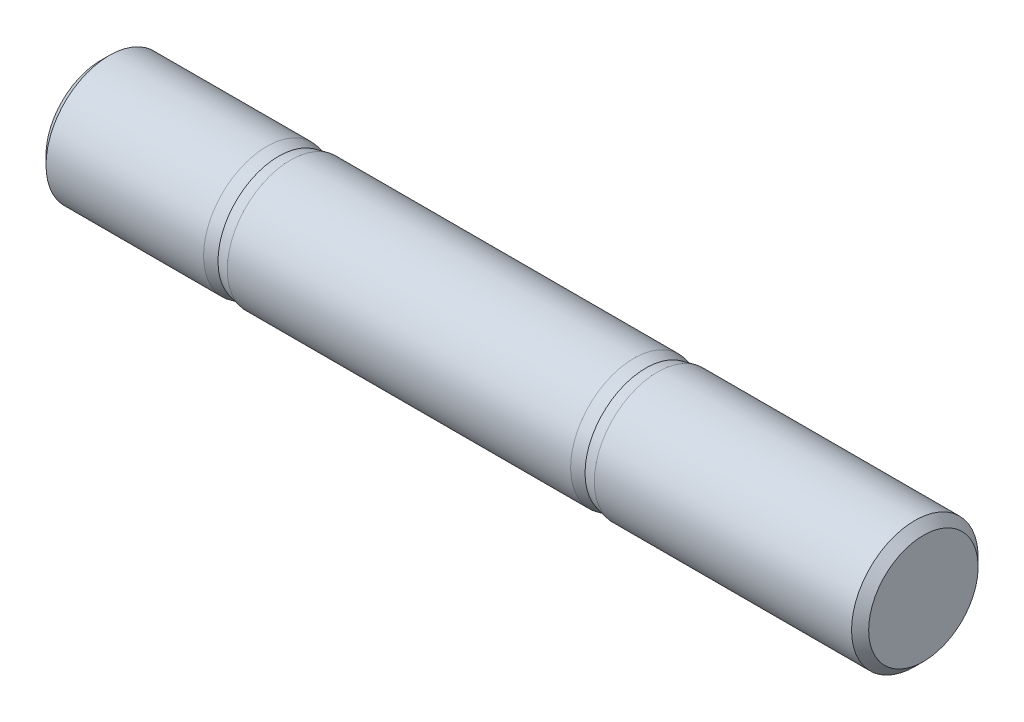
ISO-10303-21;
HEADER;
FILE_DESCRIPTION(('STEP AP214'),'2;1');
FILE_NAME('part.step','',(''),(''),'','','');
FILE_SCHEMA(('AUTOMOTIVE_DESIGN { 1 0 10303 214 1 1 1 1 }'));
ENDSEC;
DATA;
#1=APPLICATION_CONTEXT('core data for automotive mechanical design processes');
#2=APPLICATION_PROTOCOL_DEFINITION('international standard','automotive_design',2000,#1);
#3=PRODUCT_CONTEXT('',#1,'mechanical');
#4=PRODUCT('Part','Part','',(#3));
#5=PRODUCT_RELATED_PRODUCT_CATEGORY('part','',(#4));
#6=PRODUCT_DEFINITION_FORMATION('','',#4);
#7=PRODUCT_DEFINITION_CONTEXT('part definition',#1,'design');
#8=PRODUCT_DEFINITION('design','',#6,#7);
#9=PRODUCT_DEFINITION_SHAPE('','',#8);
#10=(LENGTH_UNIT() NAMED_UNIT(*) SI_UNIT(.MILLI.,.METRE.));
#11=(NAMED_UNIT(*) PLANE_ANGLE_UNIT() SI_UNIT($,.RADIAN.));
#12=(NAMED_UNIT(*) SI_UNIT($,.STERADIAN.) SOLID_ANGLE_UNIT());
#13=UNCERTAINTY_MEASURE_WITH_UNIT(LENGTH_MEASURE(1.E-05),#10,'distance_accuracy_value','');
#14=(GEOMETRIC_REPRESENTATION_CONTEXT(3) GLOBAL_UNCERTAINTY_ASSIGNED_CONTEXT((#13)) GLOBAL_UNIT_ASSIGNED_CONTEXT((#10,
#11,#12)) REPRESENTATION_CONTEXT('',''));
#15=CARTESIAN_POINT('',(0.,0.,0.));
#16=DIRECTION('',(0.,0.,1.));
#17=DIRECTION('',(1.,0.,0.));
#18=AXIS2_PLACEMENT_3D('',#15,#16,#17);
#19=CARTESIAN_POINT('',(30.,0.,0.));
#20=DIRECTION('',(-1.,0.,0.));
#21=DIRECTION('',(0.,0.,1.));
#22=AXIS2_PLACEMENT_3D('',#19,#20,#21);
#23=CONICAL_SURFACE('',#22,9.188,0.213241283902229);
#24=CARTESIAN_POINT('',(26.25,0.,0.));
#25=DIRECTION('',(-1.,0.,0.));
#26=DIRECTION('',(0.,0.,1.));
#27=AXIS2_PLACEMENT_3D('',#24,#25,#26);
#28=CIRCLE('',#27,10.);
#29=CARTESIAN_POINT('',(26.25,0.,10.));
#30=VERTEX_POINT('',#29);
#31=EDGE_CURVE('E57',#30,#30,#28,.T.);
#32=ORIENTED_EDGE('',*,*,#31,.F.);
#33=EDGE_LOOP('',(#32));
#34=FACE_BOUND('',#33,.T.);
#35=CARTESIAN_POINT('',(28.125,0.,0.));
#36=DIRECTION('',(1.,0.,0.));
#37=DIRECTION('',(0.,0.,-1.));
#38=AXIS2_PLACEMENT_3D('',#35,#36,#37);
#39=CIRCLE('',#38,9.594);
#40=CARTESIAN_POINT('',(28.125,0.,-9.594));
#41=VERTEX_POINT('',#40);
#42=EDGE_CURVE('E10',#41,#41,#39,.T.);
#43=ORIENTED_EDGE('',*,*,#42,.F.);
#44=EDGE_LOOP('',(#43));
#45=FACE_BOUND('',#44,.T.);
#46=ADVANCED_FACE('F31',(#34,#45),#23,.T.);
#47=CARTESIAN_POINT('',(0.,0.,0.));
#48=DIRECTION('',(1.,0.,0.));
#49=DIRECTION('',(0.,0.,-1.));
#50=AXIS2_PLACEMENT_3D('',#47,#48,#49);
#51=PLANE('',#50);
#52=CARTESIAN_POINT('',(0.,0.,0.));
#53=DIRECTION('',(1.,0.,0.));
#54=DIRECTION('',(0.,0.,-1.));
#55=AXIS2_PLACEMENT_3D('',#52,#53,#54);
#56=CIRCLE('',#55,8.64700000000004);
#57=CARTESIAN_POINT('',(0.,0.,-8.64700000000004));
#58=VERTEX_POINT('',#57);
#59=EDGE_CURVE('E54',#58,#58,#56,.F.);
#60=ORIENTED_EDGE('',*,*,#59,.T.);
#61=EDGE_LOOP('',(#60));
#62=FACE_BOUND('',#61,.T.);
#63=ADVANCED_FACE('F87',(#62),#51,.F.);
#64=CARTESIAN_POINT('',(-1.31084166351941,0.,0.));
#65=DIRECTION('',(-1.,0.,0.));
#66=DIRECTION('',(0.,0.,1.));
#67=AXIS2_PLACEMENT_3D('',#64,#65,#66);
#68=CYLINDRICAL_SURFACE('',#67,10.);
#69=CARTESIAN_POINT('',(1.35299999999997,0.,0.));
#70=DIRECTION('',(1.,0.,0.));
#71=DIRECTION('',(0.,0.,-1.));
#72=AXIS2_PLACEMENT_3D('',#69,#70,#71);
#73=CIRCLE('',#72,10.);
#74=CARTESIAN_POINT('',(1.35299999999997,0.,-10.));
#75=VERTEX_POINT('',#74);
#76=EDGE_CURVE('E51',#75,#75,#73,.T.);
#77=ORIENTED_EDGE('',*,*,#76,.T.);
#78=EDGE_LOOP('',(#77));
#79=FACE_BOUND('',#78,.T.);
#80=ORIENTED_EDGE('',*,*,#31,.T.);
#81=EDGE_LOOP('',(#80));
#82=FACE_BOUND('',#81,.T.);
#83=ADVANCED_FACE('F93',(#79,#82),#68,.T.);
#84=CARTESIAN_POINT('',(0.,0.,0.));
#85=DIRECTION('',(1.,0.,0.));
#86=DIRECTION('',(0.,0.,-1.));
#87=AXIS2_PLACEMENT_3D('',#84,#85,#86);
#88=CONICAL_SURFACE('',#87,8.64700000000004,0.785398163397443);
#89=ORIENTED_EDGE('',*,*,#76,.F.);
#90=EDGE_LOOP('',(#89));
#91=FACE_BOUND('',#90,.T.);
#92=ORIENTED_EDGE('',*,*,#59,.F.);
#93=EDGE_LOOP('',(#92));
#94=FACE_BOUND('',#93,.T.);
#95=ADVANCED_FACE('F83',(#91,#94),#88,.T.);
#96=CARTESIAN_POINT('',(30.,0.,0.));
#97=DIRECTION('',(1.,0.,0.));
#98=DIRECTION('',(0.,0.,-1.));
#99=AXIS2_PLACEMENT_3D('',#96,#97,#98);
#100=CONICAL_SURFACE('',#99,10.,0.213241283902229);
#101=CARTESIAN_POINT('',(30.,0.,0.));
#102=DIRECTION('',(-1.,0.,0.));
#103=DIRECTION('',(0.,0.,1.));
#104=AXIS2_PLACEMENT_3D('',#101,#102,#103);
#105=CIRCLE('',#104,10.);
#106=CARTESIAN_POINT('',(30.,0.,10.));
#107=VERTEX_POINT('',#106);
#108=EDGE_CURVE('E63',#107,#107,#105,.T.);
#109=ORIENTED_EDGE('',*,*,#108,.T.);
#110=EDGE_LOOP('',(#109));
#111=FACE_BOUND('',#110,.T.);
#112=ORIENTED_EDGE('',*,*,#42,.T.);
#113=EDGE_LOOP('',(#112));
#114=FACE_BOUND('',#113,.T.);
#115=ADVANCED_FACE('F74',(#111,#114),#100,.T.);
#116=CARTESIAN_POINT('',(88.,0.,0.));
#117=DIRECTION('',(-1.,0.,0.));
#118=DIRECTION('',(0.,0.,1.));
#119=AXIS2_PLACEMENT_3D('',#116,#117,#118);
#120=CONICAL_SURFACE('',#119,9.188,0.213241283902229);
#121=CARTESIAN_POINT('',(84.25,0.,0.));
#122=DIRECTION('',(-1.,0.,0.));
#123=DIRECTION('',(0.,0.,1.));
#124=AXIS2_PLACEMENT_3D('',#121,#122,#123);
#125=CIRCLE('',#124,10.);
#126=CARTESIAN_POINT('',(84.25,0.,10.));
#127=VERTEX_POINT('',#126);
#128=EDGE_CURVE('E66',#127,#127,#125,.T.);
#129=ORIENTED_EDGE('',*,*,#128,.F.);
#130=EDGE_LOOP('',(#129));
#131=FACE_BOUND('',#130,.T.);
#132=CARTESIAN_POINT('',(86.125,0.,0.));
#133=DIRECTION('',(-1.,0.,0.));
#134=DIRECTION('',(0.,0.,1.));
#135=AXIS2_PLACEMENT_3D('',#132,#133,#134);
#136=CIRCLE('',#135,9.594);
#137=CARTESIAN_POINT('',(86.125,0.,9.594));
#138=VERTEX_POINT('',#137);
#139=EDGE_CURVE('E38',#138,#138,#136,.T.);
#140=ORIENTED_EDGE('',*,*,#139,.T.);
#141=EDGE_LOOP('',(#140));
#142=FACE_BOUND('',#141,.T.);
#143=ADVANCED_FACE('F72',(#131,#142),#120,.T.);
#144=CARTESIAN_POINT('',(-1.31084166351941,0.,0.));
#145=DIRECTION('',(-1.,0.,0.));
#146=DIRECTION('',(0.,0.,1.));
#147=AXIS2_PLACEMENT_3D('',#144,#145,#146);
#148=CYLINDRICAL_SURFACE('',#147,10.);
#149=ORIENTED_EDGE('',*,*,#108,.F.);
#150=EDGE_LOOP('',(#149));
#151=FACE_BOUND('',#150,.T.);
#152=ORIENTED_EDGE('',*,*,#128,.T.);
#153=EDGE_LOOP('',(#152));
#154=FACE_BOUND('',#153,.T.);
#155=ADVANCED_FACE('F70',(#151,#154),#148,.T.);
#156=CARTESIAN_POINT('',(130.,10.,0.));
#157=DIRECTION('',(-1.,0.,0.));
#158=DIRECTION('',(0.,0.,1.));
#159=AXIS2_PLACEMENT_3D('',#156,#157,#158);
#160=PLANE('',#159);
#161=CARTESIAN_POINT('',(130.,0.,0.));
#162=DIRECTION('',(-1.,0.,0.));
#163=DIRECTION('',(0.,0.,1.));
#164=AXIS2_PLACEMENT_3D('',#161,#162,#163);
#165=CIRCLE('',#164,8.647);
#166=CARTESIAN_POINT('',(130.,0.,8.647));
#167=VERTEX_POINT('',#166);
#168=EDGE_CURVE('E42',#167,#167,#165,.F.);
#169=ORIENTED_EDGE('',*,*,#168,.T.);
#170=EDGE_LOOP('',(#169));
#171=FACE_BOUND('',#170,.T.);
#172=ADVANCED_FACE('F80',(#171),#160,.F.);
#173=CARTESIAN_POINT('',(128.647,0.,0.));
#174=DIRECTION('',(-1.,0.,0.));
#175=DIRECTION('',(0.,0.,1.));
#176=AXIS2_PLACEMENT_3D('',#173,#174,#175);
#177=CONICAL_SURFACE('',#176,10.,0.785398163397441);
#178=ORIENTED_EDGE('',*,*,#168,.F.);
#179=EDGE_LOOP('',(#178));
#180=FACE_BOUND('',#179,.T.);
#181=CARTESIAN_POINT('',(128.647,0.,0.));
#182=DIRECTION('',(-1.,0.,0.));
#183=DIRECTION('',(0.,0.,1.));
#184=AXIS2_PLACEMENT_3D('',#181,#182,#183);
#185=CIRCLE('',#184,10.);
#186=CARTESIAN_POINT('',(128.647,0.,10.));
#187=VERTEX_POINT('',#186);
#188=EDGE_CURVE('E46',#187,#187,#185,.T.);
#189=ORIENTED_EDGE('',*,*,#188,.F.);
#190=EDGE_LOOP('',(#189));
#191=FACE_BOUND('',#190,.T.);
#192=ADVANCED_FACE('F33',(#180,#191),#177,.T.);
#193=CARTESIAN_POINT('',(-1.31084166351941,0.,0.));
#194=DIRECTION('',(-1.,0.,0.));
#195=DIRECTION('',(0.,0.,1.));
#196=AXIS2_PLACEMENT_3D('',#193,#194,#195);
#197=CYLINDRICAL_SURFACE('',#196,10.);
#198=ORIENTED_EDGE('',*,*,#188,.T.);
#199=EDGE_LOOP('',(#198));
#200=FACE_BOUND('',#199,.T.);
#201=CARTESIAN_POINT('',(88.,0.,0.));
#202=DIRECTION('',(-1.,0.,0.));
#203=DIRECTION('',(0.,0.,1.));
#204=AXIS2_PLACEMENT_3D('',#201,#202,#203);
#205=CIRCLE('',#204,10.);
#206=CARTESIAN_POINT('',(88.,0.,10.));
#207=VERTEX_POINT('',#206);
#208=EDGE_CURVE('E60',#207,#207,#205,.T.);
#209=ORIENTED_EDGE('',*,*,#208,.F.);
#210=EDGE_LOOP('',(#209));
#211=FACE_BOUND('',#210,.T.);
#212=ADVANCED_FACE('F141',(#200,#211),#197,.T.);
#213=CARTESIAN_POINT('',(88.,0.,0.));
#214=DIRECTION('',(1.,0.,0.));
#215=DIRECTION('',(0.,0.,-1.));
#216=AXIS2_PLACEMENT_3D('',#213,#214,#215);
#217=CONICAL_SURFACE('',#216,10.,0.213241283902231);
#218=ORIENTED_EDGE('',*,*,#208,.T.);
#219=EDGE_LOOP('',(#218));
#220=FACE_BOUND('',#219,.T.);
#221=ORIENTED_EDGE('',*,*,#139,.F.);
#222=EDGE_LOOP('',(#221));
#223=FACE_BOUND('',#222,.T.);
#224=ADVANCED_FACE('F100',(#220,#223),#217,.T.);
#225=CLOSED_SHELL('',(#46,#63,#83,#95,#115,#143,#155,#172,#192,#212,#224));
#226=MANIFOLD_SOLID_BREP('B2',#225);
#227=ADVANCED_BREP_SHAPE_REPRESENTATION('',(#18,#226),#14);
#228=SHAPE_DEFINITION_REPRESENTATION(#9,#227);
ENDSEC;
END-ISO-10303-21;
